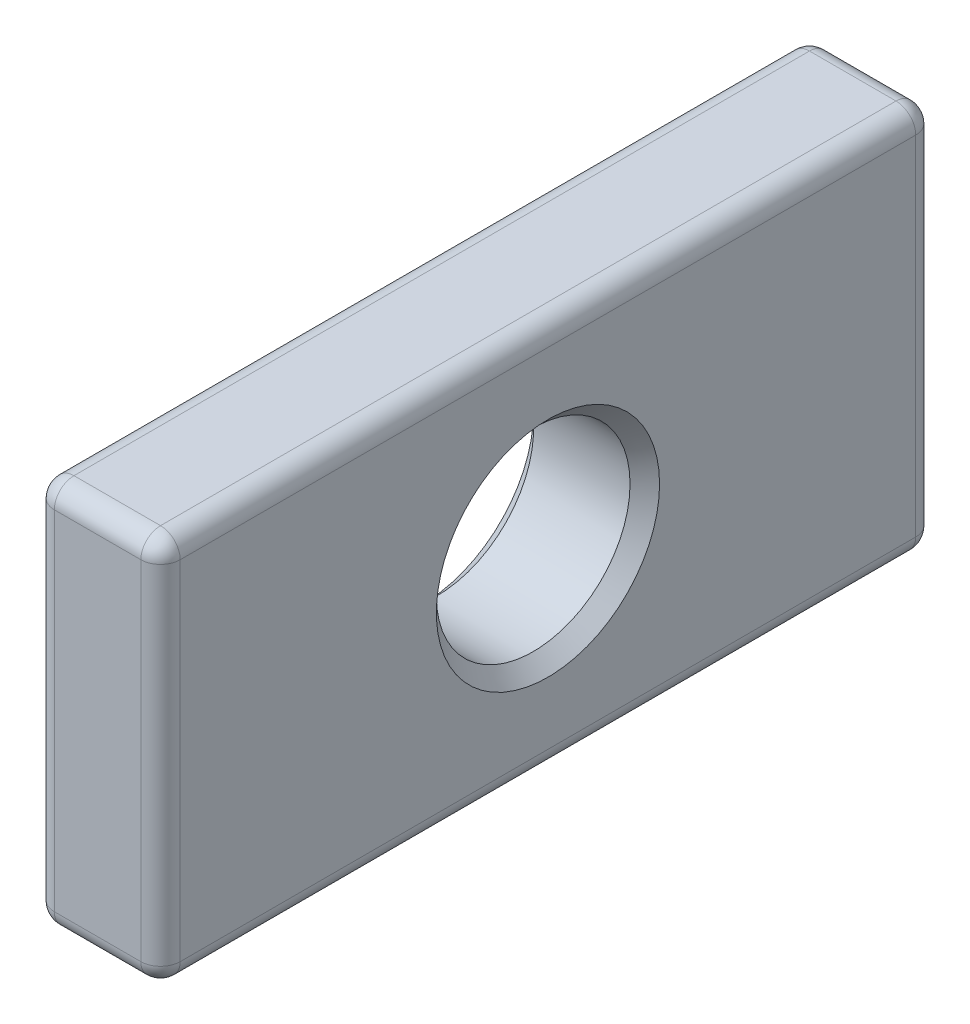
ISO-10303-21;
HEADER;
FILE_DESCRIPTION(('STEP AP214'),'2;1');
FILE_NAME('part.step','',(''),(''),'','','');
FILE_SCHEMA(('AUTOMOTIVE_DESIGN { 1 0 10303 214 1 1 1 1 }'));
ENDSEC;
DATA;
#1=APPLICATION_CONTEXT('core data for automotive mechanical design processes');
#2=APPLICATION_PROTOCOL_DEFINITION('international standard','automotive_design',2000,#1);
#3=PRODUCT_CONTEXT('',#1,'mechanical');
#4=PRODUCT('Part','Part','',(#3));
#5=PRODUCT_RELATED_PRODUCT_CATEGORY('part','',(#4));
#6=PRODUCT_DEFINITION_FORMATION('','',#4);
#7=PRODUCT_DEFINITION_CONTEXT('part definition',#1,'design');
#8=PRODUCT_DEFINITION('design','',#6,#7);
#9=PRODUCT_DEFINITION_SHAPE('','',#8);
#10=(LENGTH_UNIT() NAMED_UNIT(*) SI_UNIT(.MILLI.,.METRE.));
#11=(NAMED_UNIT(*) PLANE_ANGLE_UNIT() SI_UNIT($,.RADIAN.));
#12=(NAMED_UNIT(*) SI_UNIT($,.STERADIAN.) SOLID_ANGLE_UNIT());
#13=UNCERTAINTY_MEASURE_WITH_UNIT(LENGTH_MEASURE(1.E-05),#10,'distance_accuracy_value','');
#14=(GEOMETRIC_REPRESENTATION_CONTEXT(3) GLOBAL_UNCERTAINTY_ASSIGNED_CONTEXT((#13)) GLOBAL_UNIT_ASSIGNED_CONTEXT((#10,
#11,#12)) REPRESENTATION_CONTEXT('',''));
#15=CARTESIAN_POINT('',(0.,0.,0.));
#16=DIRECTION('',(0.,0.,1.));
#17=DIRECTION('',(1.,0.,0.));
#18=AXIS2_PLACEMENT_3D('',#15,#16,#17);
#19=CARTESIAN_POINT('',(3.25,0.,0.));
#20=DIRECTION('',(1.,0.,0.));
#21=DIRECTION('',(0.,0.,-1.));
#22=AXIS2_PLACEMENT_3D('',#19,#20,#21);
#23=PLANE('',#22);
#24=CARTESIAN_POINT('',(3.25,0.,0.));
#25=DIRECTION('',(1.,0.,0.));
#26=DIRECTION('',(0.,0.,-1.));
#27=AXIS2_PLACEMENT_3D('',#24,#25,#26);
#28=CIRCLE('',#27,5.76200000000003);
#29=CARTESIAN_POINT('',(3.25,0.,-5.76200000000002));
#30=VERTEX_POINT('',#29);
#31=EDGE_CURVE('E11',#30,#30,#28,.F.);
#32=ORIENTED_EDGE('',*,*,#31,.T.);
#33=EDGE_LOOP('',(#32));
#34=FACE_BOUND('',#33,.T.);
#35=DIRECTION('',(0.,0.,-1.));
#36=VECTOR('',#35,1.);
#37=CARTESIAN_POINT('',(3.25,-8.984,-20.));
#38=LINE('',#37,#36);
#39=CARTESIAN_POINT('',(3.25,-8.984,18.984));
#40=VERTEX_POINT('',#39);
#41=CARTESIAN_POINT('',(3.25,-8.984,-18.984));
#42=VERTEX_POINT('',#41);
#43=EDGE_CURVE('E130',#40,#42,#38,.T.);
#44=ORIENTED_EDGE('',*,*,#43,.T.);
#45=DIRECTION('',(0.,1.,0.));
#46=VECTOR('',#45,1.);
#47=CARTESIAN_POINT('',(3.25,10.,-18.984));
#48=LINE('',#47,#46);
#49=CARTESIAN_POINT('',(3.25,8.984,-18.984));
#50=VERTEX_POINT('',#49);
#51=EDGE_CURVE('E126',#42,#50,#48,.T.);
#52=ORIENTED_EDGE('',*,*,#51,.T.);
#53=DIRECTION('',(0.,0.,1.));
#54=VECTOR('',#53,1.);
#55=CARTESIAN_POINT('',(3.25,8.984,20.));
#56=LINE('',#55,#54);
#57=CARTESIAN_POINT('',(3.25,8.984,18.984));
#58=VERTEX_POINT('',#57);
#59=EDGE_CURVE('E119',#50,#58,#56,.T.);
#60=ORIENTED_EDGE('',*,*,#59,.T.);
#61=DIRECTION('',(0.,-1.,0.));
#62=VECTOR('',#61,1.);
#63=CARTESIAN_POINT('',(3.25,-10.,18.984));
#64=LINE('',#63,#62);
#65=EDGE_CURVE('E123',#58,#40,#64,.T.);
#66=ORIENTED_EDGE('',*,*,#65,.T.);
#67=EDGE_LOOP('',(#44,#52,#60,#66));
#68=FACE_BOUND('',#67,.T.);
#69=ADVANCED_FACE('F32',(#34,#68),#23,.T.);
#70=CARTESIAN_POINT('',(-3.25,0.,0.));
#71=DIRECTION('',(1.,0.,0.));
#72=DIRECTION('',(0.,0.,-1.));
#73=AXIS2_PLACEMENT_3D('',#70,#71,#72);
#74=PLANE('',#73);
#75=CARTESIAN_POINT('',(-3.25,0.,0.));
#76=DIRECTION('',(1.,0.,0.));
#77=DIRECTION('',(0.,0.,-1.));
#78=AXIS2_PLACEMENT_3D('',#75,#76,#77);
#79=CIRCLE('',#78,5.76199999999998);
#80=CARTESIAN_POINT('',(-3.25,0.,-5.76199999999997));
#81=VERTEX_POINT('',#80);
#82=EDGE_CURVE('E204',#81,#81,#79,.T.);
#83=ORIENTED_EDGE('',*,*,#82,.T.);
#84=EDGE_LOOP('',(#83));
#85=FACE_BOUND('',#84,.T.);
#86=DIRECTION('',(0.,0.,1.));
#87=VECTOR('',#86,1.);
#88=CARTESIAN_POINT('',(-3.25,8.984,0.));
#89=LINE('',#88,#87);
#90=CARTESIAN_POINT('',(-3.25,8.984,18.984));
#91=VERTEX_POINT('',#90);
#92=CARTESIAN_POINT('',(-3.25,8.984,-18.984));
#93=VERTEX_POINT('',#92);
#94=EDGE_CURVE('E175',#91,#93,#89,.F.);
#95=ORIENTED_EDGE('',*,*,#94,.T.);
#96=DIRECTION('',(0.,1.,0.));
#97=VECTOR('',#96,1.);
#98=CARTESIAN_POINT('',(-3.25,0.,-18.984));
#99=LINE('',#98,#97);
#100=CARTESIAN_POINT('',(-3.25,-8.984,-18.984));
#101=VERTEX_POINT('',#100);
#102=EDGE_CURVE('E180',#93,#101,#99,.F.);
#103=ORIENTED_EDGE('',*,*,#102,.T.);
#104=DIRECTION('',(0.,0.,-1.));
#105=VECTOR('',#104,1.);
#106=CARTESIAN_POINT('',(-3.25,-8.984,0.));
#107=LINE('',#106,#105);
#108=CARTESIAN_POINT('',(-3.25,-8.984,18.984));
#109=VERTEX_POINT('',#108);
#110=EDGE_CURVE('E177',#101,#109,#107,.F.);
#111=ORIENTED_EDGE('',*,*,#110,.T.);
#112=DIRECTION('',(0.,-1.,0.));
#113=VECTOR('',#112,1.);
#114=CARTESIAN_POINT('',(-3.25,0.,18.984));
#115=LINE('',#114,#113);
#116=EDGE_CURVE('E173',#109,#91,#115,.F.);
#117=ORIENTED_EDGE('',*,*,#116,.T.);
#118=EDGE_LOOP('',(#95,#103,#111,#117));
#119=FACE_BOUND('',#118,.T.);
#120=ADVANCED_FACE('F270',(#85,#119),#74,.F.);
#121=CARTESIAN_POINT('',(3.25,10.,-20.));
#122=DIRECTION('',(0.,0.,1.));
#123=DIRECTION('',(1.,0.,0.));
#124=AXIS2_PLACEMENT_3D('',#121,#122,#123);
#125=PLANE('',#124);
#126=DIRECTION('',(0.,1.,0.));
#127=VECTOR('',#126,1.);
#128=CARTESIAN_POINT('',(2.234,-10.,-20.));
#129=LINE('',#128,#127);
#130=CARTESIAN_POINT('',(2.234,8.984,-20.));
#131=VERTEX_POINT('',#130);
#132=CARTESIAN_POINT('',(2.234,-8.98399999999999,-20.));
#133=VERTEX_POINT('',#132);
#134=EDGE_CURVE('E193',#131,#133,#129,.F.);
#135=ORIENTED_EDGE('',*,*,#134,.T.);
#136=DIRECTION('',(-1.,0.,0.));
#137=VECTOR('',#136,1.);
#138=CARTESIAN_POINT('',(3.25,-8.98399999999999,-20.));
#139=LINE('',#138,#137);
#140=CARTESIAN_POINT('',(-2.234,-8.98399999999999,-20.));
#141=VERTEX_POINT('',#140);
#142=EDGE_CURVE('E195',#133,#141,#139,.T.);
#143=ORIENTED_EDGE('',*,*,#142,.T.);
#144=DIRECTION('',(0.,1.,0.));
#145=VECTOR('',#144,1.);
#146=CARTESIAN_POINT('',(-2.234,10.,-20.));
#147=LINE('',#146,#145);
#148=CARTESIAN_POINT('',(-2.234,8.984,-20.));
#149=VERTEX_POINT('',#148);
#150=EDGE_CURVE('E189',#141,#149,#147,.T.);
#151=ORIENTED_EDGE('',*,*,#150,.T.);
#152=DIRECTION('',(-1.,0.,0.));
#153=VECTOR('',#152,1.);
#154=CARTESIAN_POINT('',(3.25,8.984,-20.));
#155=LINE('',#154,#153);
#156=EDGE_CURVE('E191',#149,#131,#155,.F.);
#157=ORIENTED_EDGE('',*,*,#156,.T.);
#158=EDGE_LOOP('',(#135,#143,#151,#157));
#159=FACE_BOUND('',#158,.T.);
#160=ADVANCED_FACE('F273',(#159),#125,.F.);
#161=CARTESIAN_POINT('',(3.25,10.,20.));
#162=DIRECTION('',(0.,-1.,0.));
#163=DIRECTION('',(0.,0.,-1.));
#164=AXIS2_PLACEMENT_3D('',#161,#162,#163);
#165=PLANE('',#164);
#166=DIRECTION('',(0.,0.,1.));
#167=VECTOR('',#166,1.);
#168=CARTESIAN_POINT('',(2.234,10.,-20.));
#169=LINE('',#168,#167);
#170=CARTESIAN_POINT('',(2.234,10.,18.984));
#171=VERTEX_POINT('',#170);
#172=CARTESIAN_POINT('',(2.234,10.,-18.984));
#173=VERTEX_POINT('',#172);
#174=EDGE_CURVE('E138',#171,#173,#169,.F.);
#175=ORIENTED_EDGE('',*,*,#174,.T.);
#176=DIRECTION('',(-1.,0.,0.));
#177=VECTOR('',#176,1.);
#178=CARTESIAN_POINT('',(3.25,10.,-18.984));
#179=LINE('',#178,#177);
#180=CARTESIAN_POINT('',(-2.234,10.,-18.984));
#181=VERTEX_POINT('',#180);
#182=EDGE_CURVE('E187',#173,#181,#179,.T.);
#183=ORIENTED_EDGE('',*,*,#182,.T.);
#184=DIRECTION('',(0.,0.,1.));
#185=VECTOR('',#184,1.);
#186=CARTESIAN_POINT('',(-2.234,10.,20.));
#187=LINE('',#186,#185);
#188=CARTESIAN_POINT('',(-2.234,10.,18.984));
#189=VERTEX_POINT('',#188);
#190=EDGE_CURVE('E184',#181,#189,#187,.T.);
#191=ORIENTED_EDGE('',*,*,#190,.T.);
#192=DIRECTION('',(-1.,0.,0.));
#193=VECTOR('',#192,1.);
#194=CARTESIAN_POINT('',(3.25,10.,18.984));
#195=LINE('',#194,#193);
#196=EDGE_CURVE('E182',#189,#171,#195,.F.);
#197=ORIENTED_EDGE('',*,*,#196,.T.);
#198=EDGE_LOOP('',(#175,#183,#191,#197));
#199=FACE_BOUND('',#198,.T.);
#200=ADVANCED_FACE('F317',(#199),#165,.F.);
#201=CARTESIAN_POINT('',(3.25,10.,20.));
#202=DIRECTION('',(0.,0.,-1.));
#203=DIRECTION('',(-1.,0.,0.));
#204=AXIS2_PLACEMENT_3D('',#201,#202,#203);
#205=PLANE('',#204);
#206=DIRECTION('',(0.,-1.,0.));
#207=VECTOR('',#206,1.);
#208=CARTESIAN_POINT('',(2.234,10.,20.));
#209=LINE('',#208,#207);
#210=CARTESIAN_POINT('',(2.234,-8.984,20.));
#211=VERTEX_POINT('',#210);
#212=CARTESIAN_POINT('',(2.234,8.984,20.));
#213=VERTEX_POINT('',#212);
#214=EDGE_CURVE('E47',#211,#213,#209,.F.);
#215=ORIENTED_EDGE('',*,*,#214,.T.);
#216=DIRECTION('',(-1.,0.,0.));
#217=VECTOR('',#216,1.);
#218=CARTESIAN_POINT('',(3.25,8.984,20.));
#219=LINE('',#218,#217);
#220=CARTESIAN_POINT('',(-2.234,8.984,20.));
#221=VERTEX_POINT('',#220);
#222=EDGE_CURVE('E202',#213,#221,#219,.T.);
#223=ORIENTED_EDGE('',*,*,#222,.T.);
#224=DIRECTION('',(0.,-1.,0.));
#225=VECTOR('',#224,1.);
#226=CARTESIAN_POINT('',(-2.234,10.,20.));
#227=LINE('',#226,#225);
#228=CARTESIAN_POINT('',(-2.234,-8.984,20.));
#229=VERTEX_POINT('',#228);
#230=EDGE_CURVE('E198',#221,#229,#227,.T.);
#231=ORIENTED_EDGE('',*,*,#230,.T.);
#232=DIRECTION('',(-1.,0.,0.));
#233=VECTOR('',#232,1.);
#234=CARTESIAN_POINT('',(3.25,-8.984,20.));
#235=LINE('',#234,#233);
#236=EDGE_CURVE('E52',#229,#211,#235,.F.);
#237=ORIENTED_EDGE('',*,*,#236,.T.);
#238=EDGE_LOOP('',(#215,#223,#231,#237));
#239=FACE_BOUND('',#238,.T.);
#240=ADVANCED_FACE('F314',(#239),#205,.F.);
#241=CARTESIAN_POINT('',(3.25,-10.,20.));
#242=DIRECTION('',(0.,1.,0.));
#243=DIRECTION('',(0.,0.,1.));
#244=AXIS2_PLACEMENT_3D('',#241,#242,#243);
#245=PLANE('',#244);
#246=DIRECTION('',(0.,0.,-1.));
#247=VECTOR('',#246,1.);
#248=CARTESIAN_POINT('',(-2.234,-10.,20.));
#249=LINE('',#248,#247);
#250=CARTESIAN_POINT('',(-2.234,-10.,18.984));
#251=VERTEX_POINT('',#250);
#252=CARTESIAN_POINT('',(-2.234,-10.,-18.984));
#253=VERTEX_POINT('',#252);
#254=EDGE_CURVE('E166',#251,#253,#249,.T.);
#255=ORIENTED_EDGE('',*,*,#254,.T.);
#256=DIRECTION('',(-1.,0.,0.));
#257=VECTOR('',#256,1.);
#258=CARTESIAN_POINT('',(3.25,-10.,-18.984));
#259=LINE('',#258,#257);
#260=CARTESIAN_POINT('',(2.234,-10.,-18.984));
#261=VERTEX_POINT('',#260);
#262=EDGE_CURVE('E171',#253,#261,#259,.F.);
#263=ORIENTED_EDGE('',*,*,#262,.T.);
#264=DIRECTION('',(0.,0.,-1.));
#265=VECTOR('',#264,1.);
#266=CARTESIAN_POINT('',(2.234,-10.,20.));
#267=LINE('',#266,#265);
#268=CARTESIAN_POINT('',(2.234,-10.,18.984));
#269=VERTEX_POINT('',#268);
#270=EDGE_CURVE('E168',#261,#269,#267,.F.);
#271=ORIENTED_EDGE('',*,*,#270,.T.);
#272=DIRECTION('',(-1.,0.,0.));
#273=VECTOR('',#272,1.);
#274=CARTESIAN_POINT('',(3.25,-10.,18.984));
#275=LINE('',#274,#273);
#276=EDGE_CURVE('E164',#269,#251,#275,.T.);
#277=ORIENTED_EDGE('',*,*,#276,.T.);
#278=EDGE_LOOP('',(#255,#263,#271,#277));
#279=FACE_BOUND('',#278,.T.);
#280=ADVANCED_FACE('F316',(#279),#245,.F.);
#281=CARTESIAN_POINT('',(3.25,0.,0.));
#282=DIRECTION('',(-1.,0.,0.));
#283=DIRECTION('',(0.,0.,1.));
#284=AXIS2_PLACEMENT_3D('',#281,#282,#283);
#285=CYLINDRICAL_SURFACE('',#284,5.);
#286=CARTESIAN_POINT('',(-2.48800000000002,0.,0.));
#287=DIRECTION('',(1.,0.,0.));
#288=DIRECTION('',(0.,0.,-1.));
#289=AXIS2_PLACEMENT_3D('',#286,#287,#288);
#290=CIRCLE('',#289,5.);
#291=CARTESIAN_POINT('',(-2.48800000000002,0.,5.00000000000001));
#292=VERTEX_POINT('',#291);
#293=EDGE_CURVE('E40',#292,#292,#290,.F.);
#294=CARTESIAN_POINT('',(2.48799999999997,0.,0.));
#295=DIRECTION('',(1.,0.,0.));
#296=DIRECTION('',(0.,0.,-1.));
#297=AXIS2_PLACEMENT_3D('',#294,#295,#296);
#298=CIRCLE('',#297,5.);
#299=CARTESIAN_POINT('',(2.48799999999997,0.,5.00000000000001));
#300=VERTEX_POINT('',#299);
#301=EDGE_CURVE('E256',#300,#300,#298,.T.);
#302=CARTESIAN_POINT('',(-2.48800000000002,0.,5.00000000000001));
#303=CARTESIAN_POINT('',(-2.43616666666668,0.,5.00000000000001));
#304=CARTESIAN_POINT('',(-2.38433333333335,0.,5.00000000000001));
#305=CARTESIAN_POINT('',(-2.28066666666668,0.,5.00000000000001));
#306=CARTESIAN_POINT('',(-2.22883333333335,0.,5.00000000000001));
#307=CARTESIAN_POINT('',(-2.12516666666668,0.,5.00000000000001));
#308=CARTESIAN_POINT('',(-2.07333333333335,0.,5.00000000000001));
#309=CARTESIAN_POINT('',(-1.96966666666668,0.,5.00000000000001));
#310=CARTESIAN_POINT('',(-1.91783333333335,0.,5.00000000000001));
#311=CARTESIAN_POINT('',(-1.81416666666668,0.,5.00000000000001));
#312=CARTESIAN_POINT('',(-1.76233333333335,0.,5.00000000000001));
#313=CARTESIAN_POINT('',(-1.65866666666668,0.,5.00000000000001));
#314=CARTESIAN_POINT('',(-1.60683333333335,0.,5.00000000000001));
#315=CARTESIAN_POINT('',(-1.50316666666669,0.,5.00000000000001));
#316=CARTESIAN_POINT('',(-1.45133333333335,0.,5.00000000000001));
#317=CARTESIAN_POINT('',(-1.34766666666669,0.,5.00000000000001));
#318=CARTESIAN_POINT('',(-1.29583333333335,0.,5.00000000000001));
#319=CARTESIAN_POINT('',(-1.19216666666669,0.,5.00000000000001));
#320=CARTESIAN_POINT('',(-1.14033333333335,0.,5.00000000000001));
#321=CARTESIAN_POINT('',(-1.03666666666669,0.,5.00000000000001));
#322=CARTESIAN_POINT('',(-0.984833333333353,0.,5.00000000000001));
#323=CARTESIAN_POINT('',(-0.881166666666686,0.,5.00000000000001));
#324=CARTESIAN_POINT('',(-0.829333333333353,0.,5.00000000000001));
#325=CARTESIAN_POINT('',(-0.725666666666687,0.,5.00000000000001));
#326=CARTESIAN_POINT('',(-0.673833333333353,0.,5.00000000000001));
#327=CARTESIAN_POINT('',(-0.570166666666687,0.,5.00000000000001));
#328=CARTESIAN_POINT('',(-0.518333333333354,0.,5.00000000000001));
#329=CARTESIAN_POINT('',(-0.414666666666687,0.,5.00000000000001));
#330=CARTESIAN_POINT('',(-0.362833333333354,0.,5.00000000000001));
#331=CARTESIAN_POINT('',(-0.259166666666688,0.,5.00000000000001));
#332=CARTESIAN_POINT('',(-0.207333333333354,0.,5.00000000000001));
#333=CARTESIAN_POINT('',(-0.103666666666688,0.,5.00000000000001));
#334=CARTESIAN_POINT('',(-0.0518333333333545,0.,5.00000000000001));
#335=CARTESIAN_POINT('',(0.051833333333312,0.,5.00000000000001));
#336=CARTESIAN_POINT('',(0.103666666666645,0.,5.00000000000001));
#337=CARTESIAN_POINT('',(0.207333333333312,0.,5.00000000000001));
#338=CARTESIAN_POINT('',(0.259166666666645,0.,5.00000000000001));
#339=CARTESIAN_POINT('',(0.362833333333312,0.,5.00000000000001));
#340=CARTESIAN_POINT('',(0.414666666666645,0.,5.00000000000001));
#341=CARTESIAN_POINT('',(0.518333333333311,0.,5.00000000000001));
#342=CARTESIAN_POINT('',(0.570166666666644,0.,5.00000000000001));
#343=CARTESIAN_POINT('',(0.673833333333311,0.,5.00000000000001));
#344=CARTESIAN_POINT('',(0.725666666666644,0.,5.00000000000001));
#345=CARTESIAN_POINT('',(0.829333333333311,0.,5.00000000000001));
#346=CARTESIAN_POINT('',(0.881166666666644,0.,5.00000000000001));
#347=CARTESIAN_POINT('',(0.98483333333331,0.,5.00000000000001));
#348=CARTESIAN_POINT('',(1.03666666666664,0.,5.00000000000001));
#349=CARTESIAN_POINT('',(1.14033333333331,0.,5.00000000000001));
#350=CARTESIAN_POINT('',(1.19216666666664,0.,5.00000000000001));
#351=CARTESIAN_POINT('',(1.29583333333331,0.,5.00000000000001));
#352=CARTESIAN_POINT('',(1.34766666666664,0.,5.00000000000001));
#353=CARTESIAN_POINT('',(1.45133333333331,0.,5.00000000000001));
#354=CARTESIAN_POINT('',(1.50316666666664,0.,5.00000000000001));
#355=CARTESIAN_POINT('',(1.60683333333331,0.,5.00000000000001));
#356=CARTESIAN_POINT('',(1.65866666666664,0.,5.00000000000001));
#357=CARTESIAN_POINT('',(1.76233333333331,0.,5.00000000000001));
#358=CARTESIAN_POINT('',(1.81416666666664,0.,5.00000000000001));
#359=CARTESIAN_POINT('',(1.91783333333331,0.,5.00000000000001));
#360=CARTESIAN_POINT('',(1.96966666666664,0.,5.00000000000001));
#361=CARTESIAN_POINT('',(2.07333333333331,0.,5.00000000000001));
#362=CARTESIAN_POINT('',(2.12516666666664,0.,5.00000000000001));
#363=CARTESIAN_POINT('',(2.22883333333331,0.,5.00000000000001));
#364=CARTESIAN_POINT('',(2.28066666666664,0.,5.00000000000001));
#365=CARTESIAN_POINT('',(2.38433333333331,0.,5.00000000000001));
#366=CARTESIAN_POINT('',(2.43616666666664,0.,5.00000000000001));
#367=CARTESIAN_POINT('',(2.48799999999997,0.,5.00000000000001));
#368=B_SPLINE_CURVE_WITH_KNOTS('',3,(#302,#303,#304,#305,#306,#307,#308,#309,#310,#311,#312,
#313,#314,#315,#316,#317,#318,#319,#320,#321,#322,#323,#324,#325,#326,#327,#328,#329,#330,#331,
#332,#333,#334,#335,#336,#337,#338,#339,#340,#341,#342,#343,#344,#345,#346,#347,#348,#349,#350,
#351,#352,#353,#354,#355,#356,#357,#358,#359,#360,#361,#362,#363,#364,#365,#366,#367),
.UNSPECIFIED.,.F.,.F.,(4,2,2,2,2,2,2,2,2,2,2,2,2,2,2,2,2,2,2,2,2,2,2,2,2,2,2,2,2,2,2,2,4),(0.,
0.155499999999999,0.311,0.466499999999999,0.621999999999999,0.777499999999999,0.932999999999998,
1.0885,1.244,1.3995,1.555,1.7105,1.866,2.0215,2.177,2.3325,2.488,2.6435,2.799,2.95449999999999,
3.10999999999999,3.26549999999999,3.42099999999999,3.57649999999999,3.73199999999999,
3.88749999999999,4.04299999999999,4.19849999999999,4.35399999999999,4.50949999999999,
4.66499999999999,4.82049999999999,4.97599999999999),.UNSPECIFIED.);
#369=EDGE_CURVE('BSEAM261',#292,#300,#368,.T.);
#370=ORIENTED_EDGE('',*,*,#293,.T.);
#371=ORIENTED_EDGE('',*,*,#301,.T.);
#372=ORIENTED_EDGE('',*,*,#369,.T.);
#373=ORIENTED_EDGE('',*,*,#369,.F.);
#374=EDGE_LOOP('',(#370,#372,#371,#373));
#375=FACE_BOUND('',#374,.T.);
#376=ADVANCED_FACE('F261',(#375),#285,.F.);
#377=CARTESIAN_POINT('',(-2.234,8.984,20.));
#378=DIRECTION('',(0.,0.,1.));
#379=DIRECTION('',(1.,0.,0.));
#380=AXIS2_PLACEMENT_3D('',#377,#378,#379);
#381=CYLINDRICAL_SURFACE('',#380,1.016);
#382=CARTESIAN_POINT('',(-2.234,8.984,18.984));
#383=DIRECTION('',(0.,0.,1.));
#384=DIRECTION('',(1.,0.,0.));
#385=AXIS2_PLACEMENT_3D('',#382,#383,#384);
#386=CIRCLE('',#385,1.016);
#387=EDGE_CURVE('E156',#189,#91,#386,.T.);
#388=ORIENTED_EDGE('',*,*,#387,.F.);
#389=ORIENTED_EDGE('',*,*,#190,.F.);
#390=CARTESIAN_POINT('',(-2.234,8.984,-18.984));
#391=DIRECTION('',(0.,0.,-1.));
#392=DIRECTION('',(0.,1.,0.));
#393=AXIS2_PLACEMENT_3D('',#390,#391,#392);
#394=CIRCLE('',#393,1.016);
#395=EDGE_CURVE('E159',#93,#181,#394,.T.);
#396=ORIENTED_EDGE('',*,*,#395,.F.);
#397=ORIENTED_EDGE('',*,*,#94,.F.);
#398=EDGE_LOOP('',(#388,#389,#396,#397));
#399=FACE_BOUND('',#398,.T.);
#400=ADVANCED_FACE('F284',(#399),#381,.T.);
#401=CARTESIAN_POINT('',(-2.234,8.984,18.984));
#402=DIRECTION('',(0.,0.,1.));
#403=DIRECTION('',(1.,0.,0.));
#404=AXIS2_PLACEMENT_3D('',#401,#402,#403);
#405=SPHERICAL_SURFACE('',#404,1.016);
#406=CARTESIAN_POINT('',(-2.234,8.984,18.984));
#407=DIRECTION('',(-1.,0.,0.));
#408=DIRECTION('',(0.,0.,1.));
#409=AXIS2_PLACEMENT_3D('',#406,#407,#408);
#410=CIRCLE('',#409,1.016);
#411=EDGE_CURVE('E246',#189,#221,#410,.F.);
#412=ORIENTED_EDGE('',*,*,#411,.F.);
#413=ORIENTED_EDGE('',*,*,#387,.T.);
#414=CARTESIAN_POINT('',(-2.234,8.984,18.984));
#415=DIRECTION('',(0.,1.,0.));
#416=DIRECTION('',(0.,0.,1.));
#417=AXIS2_PLACEMENT_3D('',#414,#415,#416);
#418=CIRCLE('',#417,1.016);
#419=EDGE_CURVE('E249',#221,#91,#418,.F.);
#420=ORIENTED_EDGE('',*,*,#419,.F.);
#421=EDGE_LOOP('',(#412,#413,#420));
#422=FACE_BOUND('',#421,.T.);
#423=ADVANCED_FACE('F310',(#422),#405,.T.);
#424=CARTESIAN_POINT('',(-2.234,8.984,-18.984));
#425=DIRECTION('',(0.,0.,1.));
#426=DIRECTION('',(1.,0.,0.));
#427=AXIS2_PLACEMENT_3D('',#424,#425,#426);
#428=SPHERICAL_SURFACE('',#427,1.016);
#429=CARTESIAN_POINT('',(-2.234,8.984,-18.984));
#430=DIRECTION('',(0.,1.,0.));
#431=DIRECTION('',(0.,0.,1.));
#432=AXIS2_PLACEMENT_3D('',#429,#430,#431);
#433=CIRCLE('',#432,1.016);
#434=EDGE_CURVE('E240',#93,#149,#433,.F.);
#435=ORIENTED_EDGE('',*,*,#434,.F.);
#436=ORIENTED_EDGE('',*,*,#395,.T.);
#437=CARTESIAN_POINT('',(-2.234,8.984,-18.984));
#438=DIRECTION('',(-1.,0.,0.));
#439=DIRECTION('',(0.,0.,1.));
#440=AXIS2_PLACEMENT_3D('',#437,#438,#439);
#441=CIRCLE('',#440,1.016);
#442=EDGE_CURVE('E243',#149,#181,#441,.F.);
#443=ORIENTED_EDGE('',*,*,#442,.F.);
#444=EDGE_LOOP('',(#435,#436,#443));
#445=FACE_BOUND('',#444,.T.);
#446=ADVANCED_FACE('F287',(#445),#428,.T.);
#447=CARTESIAN_POINT('',(-2.234,10.,18.984));
#448=DIRECTION('',(0.,-1.,0.));
#449=DIRECTION('',(0.,0.,-1.));
#450=AXIS2_PLACEMENT_3D('',#447,#448,#449);
#451=CYLINDRICAL_SURFACE('',#450,1.016);
#452=ORIENTED_EDGE('',*,*,#419,.T.);
#453=ORIENTED_EDGE('',*,*,#116,.F.);
#454=CARTESIAN_POINT('',(-2.234,-8.984,18.984));
#455=DIRECTION('',(0.,-1.,0.));
#456=DIRECTION('',(0.,0.,-1.));
#457=AXIS2_PLACEMENT_3D('',#454,#455,#456);
#458=CIRCLE('',#457,1.016);
#459=EDGE_CURVE('E235',#229,#109,#458,.T.);
#460=ORIENTED_EDGE('',*,*,#459,.F.);
#461=ORIENTED_EDGE('',*,*,#230,.F.);
#462=EDGE_LOOP('',(#452,#453,#460,#461));
#463=FACE_BOUND('',#462,.T.);
#464=ADVANCED_FACE('F306',(#463),#451,.T.);
#465=CARTESIAN_POINT('',(3.25,8.984,18.984));
#466=DIRECTION('',(-1.,0.,0.));
#467=DIRECTION('',(0.,0.,1.));
#468=AXIS2_PLACEMENT_3D('',#465,#466,#467);
#469=CYLINDRICAL_SURFACE('',#468,1.016);
#470=ORIENTED_EDGE('',*,*,#411,.T.);
#471=ORIENTED_EDGE('',*,*,#222,.F.);
#472=CARTESIAN_POINT('',(2.234,8.984,18.984));
#473=DIRECTION('',(1.,0.,0.));
#474=DIRECTION('',(0.,0.,-1.));
#475=AXIS2_PLACEMENT_3D('',#472,#473,#474);
#476=CIRCLE('',#475,1.016);
#477=EDGE_CURVE('E142',#171,#213,#476,.T.);
#478=ORIENTED_EDGE('',*,*,#477,.F.);
#479=ORIENTED_EDGE('',*,*,#196,.F.);
#480=EDGE_LOOP('',(#470,#471,#478,#479));
#481=FACE_BOUND('',#480,.T.);
#482=ADVANCED_FACE('F313',(#481),#469,.T.);
#483=CARTESIAN_POINT('',(2.234,8.984,0.));
#484=DIRECTION('',(0.,0.,-1.));
#485=DIRECTION('',(-1.,0.,0.));
#486=AXIS2_PLACEMENT_3D('',#483,#484,#485);
#487=CYLINDRICAL_SURFACE('',#486,1.016);
#488=CARTESIAN_POINT('',(2.234,8.984,-18.984));
#489=DIRECTION('',(0.,0.,-1.));
#490=DIRECTION('',(-1.,0.,0.));
#491=AXIS2_PLACEMENT_3D('',#488,#489,#490);
#492=CIRCLE('',#491,1.016);
#493=EDGE_CURVE('E143',#173,#50,#492,.T.);
#494=ORIENTED_EDGE('',*,*,#493,.F.);
#495=ORIENTED_EDGE('',*,*,#174,.F.);
#496=CARTESIAN_POINT('',(2.234,8.984,18.984));
#497=DIRECTION('',(0.,0.,1.));
#498=DIRECTION('',(1.,0.,0.));
#499=AXIS2_PLACEMENT_3D('',#496,#497,#498);
#500=CIRCLE('',#499,1.016);
#501=EDGE_CURVE('E134',#58,#171,#500,.T.);
#502=ORIENTED_EDGE('',*,*,#501,.F.);
#503=ORIENTED_EDGE('',*,*,#59,.F.);
#504=EDGE_LOOP('',(#494,#495,#502,#503));
#505=FACE_BOUND('',#504,.T.);
#506=ADVANCED_FACE('F136',(#505),#487,.T.);
#507=CARTESIAN_POINT('',(3.25,8.984,-18.984));
#508=DIRECTION('',(-1.,0.,0.));
#509=DIRECTION('',(0.,0.,1.));
#510=AXIS2_PLACEMENT_3D('',#507,#508,#509);
#511=CYLINDRICAL_SURFACE('',#510,1.016);
#512=ORIENTED_EDGE('',*,*,#442,.T.);
#513=ORIENTED_EDGE('',*,*,#182,.F.);
#514=CARTESIAN_POINT('',(2.234,8.984,-18.984));
#515=DIRECTION('',(1.,0.,0.));
#516=DIRECTION('',(0.,0.,-1.));
#517=AXIS2_PLACEMENT_3D('',#514,#515,#516);
#518=CIRCLE('',#517,1.016);
#519=EDGE_CURVE('E231',#131,#173,#518,.T.);
#520=ORIENTED_EDGE('',*,*,#519,.F.);
#521=ORIENTED_EDGE('',*,*,#156,.F.);
#522=EDGE_LOOP('',(#512,#513,#520,#521));
#523=FACE_BOUND('',#522,.T.);
#524=ADVANCED_FACE('F351',(#523),#511,.T.);
#525=CARTESIAN_POINT('',(-2.234,10.,-18.984));
#526=DIRECTION('',(0.,1.,0.));
#527=DIRECTION('',(0.,0.,1.));
#528=AXIS2_PLACEMENT_3D('',#525,#526,#527);
#529=CYLINDRICAL_SURFACE('',#528,1.016);
#530=ORIENTED_EDGE('',*,*,#434,.T.);
#531=ORIENTED_EDGE('',*,*,#150,.F.);
#532=CARTESIAN_POINT('',(-2.234,-8.984,-18.984));
#533=DIRECTION('',(0.,-1.,0.));
#534=DIRECTION('',(0.,0.,-1.));
#535=AXIS2_PLACEMENT_3D('',#532,#533,#534);
#536=CIRCLE('',#535,1.016);
#537=EDGE_CURVE('E228',#101,#141,#536,.T.);
#538=ORIENTED_EDGE('',*,*,#537,.F.);
#539=ORIENTED_EDGE('',*,*,#102,.F.);
#540=EDGE_LOOP('',(#530,#531,#538,#539));
#541=FACE_BOUND('',#540,.T.);
#542=ADVANCED_FACE('F292',(#541),#529,.T.);
#543=CARTESIAN_POINT('',(-2.234,-8.984,20.));
#544=DIRECTION('',(0.,0.,-1.));
#545=DIRECTION('',(-1.,0.,0.));
#546=AXIS2_PLACEMENT_3D('',#543,#544,#545);
#547=CYLINDRICAL_SURFACE('',#546,1.016);
#548=CARTESIAN_POINT('',(-2.234,-8.984,18.984));
#549=DIRECTION('',(0.,0.,1.));
#550=DIRECTION('',(1.,0.,0.));
#551=AXIS2_PLACEMENT_3D('',#548,#549,#550);
#552=CIRCLE('',#551,1.016);
#553=EDGE_CURVE('E237',#109,#251,#552,.T.);
#554=ORIENTED_EDGE('',*,*,#553,.F.);
#555=ORIENTED_EDGE('',*,*,#110,.F.);
#556=CARTESIAN_POINT('',(-2.234,-8.984,-18.984));
#557=DIRECTION('',(0.,0.,-1.));
#558=DIRECTION('',(-1.,0.,0.));
#559=AXIS2_PLACEMENT_3D('',#556,#557,#558);
#560=CIRCLE('',#559,1.016);
#561=EDGE_CURVE('E225',#253,#101,#560,.T.);
#562=ORIENTED_EDGE('',*,*,#561,.F.);
#563=ORIENTED_EDGE('',*,*,#254,.F.);
#564=EDGE_LOOP('',(#554,#555,#562,#563));
#565=FACE_BOUND('',#564,.T.);
#566=ADVANCED_FACE('F301',(#565),#547,.T.);
#567=CARTESIAN_POINT('',(-2.234,-8.984,18.984));
#568=DIRECTION('',(0.,0.,1.));
#569=DIRECTION('',(1.,0.,0.));
#570=AXIS2_PLACEMENT_3D('',#567,#568,#569);
#571=SPHERICAL_SURFACE('',#570,1.016);
#572=ORIENTED_EDGE('',*,*,#459,.T.);
#573=ORIENTED_EDGE('',*,*,#553,.T.);
#574=CARTESIAN_POINT('',(-2.234,-8.984,18.984));
#575=DIRECTION('',(-1.,0.,0.));
#576=DIRECTION('',(0.,0.,1.));
#577=AXIS2_PLACEMENT_3D('',#574,#575,#576);
#578=CIRCLE('',#577,1.016);
#579=EDGE_CURVE('E149',#229,#251,#578,.F.);
#580=ORIENTED_EDGE('',*,*,#579,.F.);
#581=EDGE_LOOP('',(#572,#573,#580));
#582=FACE_BOUND('',#581,.T.);
#583=ADVANCED_FACE('F359',(#582),#571,.T.);
#584=CARTESIAN_POINT('',(2.234,8.984,18.984));
#585=DIRECTION('',(0.,0.,1.));
#586=DIRECTION('',(1.,0.,0.));
#587=AXIS2_PLACEMENT_3D('',#584,#585,#586);
#588=SPHERICAL_SURFACE('',#587,1.016);
#589=ORIENTED_EDGE('',*,*,#501,.T.);
#590=ORIENTED_EDGE('',*,*,#477,.T.);
#591=CARTESIAN_POINT('',(2.234,8.984,18.984));
#592=DIRECTION('',(0.,1.,0.));
#593=DIRECTION('',(0.,0.,1.));
#594=AXIS2_PLACEMENT_3D('',#591,#592,#593);
#595=CIRCLE('',#594,1.016);
#596=EDGE_CURVE('E146',#58,#213,#595,.F.);
#597=ORIENTED_EDGE('',*,*,#596,.F.);
#598=EDGE_LOOP('',(#589,#590,#597));
#599=FACE_BOUND('',#598,.T.);
#600=ADVANCED_FACE('F147',(#599),#588,.T.);
#601=CARTESIAN_POINT('',(2.234,8.984,-18.984));
#602=DIRECTION('',(0.,0.,1.));
#603=DIRECTION('',(1.,0.,0.));
#604=AXIS2_PLACEMENT_3D('',#601,#602,#603);
#605=SPHERICAL_SURFACE('',#604,1.016);
#606=ORIENTED_EDGE('',*,*,#519,.T.);
#607=ORIENTED_EDGE('',*,*,#493,.T.);
#608=CARTESIAN_POINT('',(2.234,8.984,-18.984));
#609=DIRECTION('',(0.,1.,0.));
#610=DIRECTION('',(0.,0.,1.));
#611=AXIS2_PLACEMENT_3D('',#608,#609,#610);
#612=CIRCLE('',#611,1.016);
#613=EDGE_CURVE('E150',#131,#50,#612,.F.);
#614=ORIENTED_EDGE('',*,*,#613,.F.);
#615=EDGE_LOOP('',(#606,#607,#614));
#616=FACE_BOUND('',#615,.T.);
#617=ADVANCED_FACE('F364',(#616),#605,.T.);
#618=CARTESIAN_POINT('',(-2.234,-8.984,-18.984));
#619=DIRECTION('',(0.,0.,1.));
#620=DIRECTION('',(1.,0.,0.));
#621=AXIS2_PLACEMENT_3D('',#618,#619,#620);
#622=SPHERICAL_SURFACE('',#621,1.016);
#623=ORIENTED_EDGE('',*,*,#561,.T.);
#624=ORIENTED_EDGE('',*,*,#537,.T.);
#625=CARTESIAN_POINT('',(-2.234,-8.98399999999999,-18.984));
#626=DIRECTION('',(-1.,0.,0.));
#627=DIRECTION('',(0.,0.,1.));
#628=AXIS2_PLACEMENT_3D('',#625,#626,#627);
#629=CIRCLE('',#628,1.016);
#630=EDGE_CURVE('E219',#253,#141,#629,.F.);
#631=ORIENTED_EDGE('',*,*,#630,.F.);
#632=EDGE_LOOP('',(#623,#624,#631));
#633=FACE_BOUND('',#632,.T.);
#634=ADVANCED_FACE('F296',(#633),#622,.T.);
#635=CARTESIAN_POINT('',(3.25,-8.984,18.984));
#636=DIRECTION('',(-1.,0.,0.));
#637=DIRECTION('',(0.,0.,1.));
#638=AXIS2_PLACEMENT_3D('',#635,#636,#637);
#639=CYLINDRICAL_SURFACE('',#638,1.016);
#640=ORIENTED_EDGE('',*,*,#579,.T.);
#641=ORIENTED_EDGE('',*,*,#276,.F.);
#642=CARTESIAN_POINT('',(2.234,-8.984,18.984));
#643=DIRECTION('',(1.,0.,0.));
#644=DIRECTION('',(0.,0.,-1.));
#645=AXIS2_PLACEMENT_3D('',#642,#643,#644);
#646=CIRCLE('',#645,1.016);
#647=EDGE_CURVE('E216',#211,#269,#646,.T.);
#648=ORIENTED_EDGE('',*,*,#647,.F.);
#649=ORIENTED_EDGE('',*,*,#236,.F.);
#650=EDGE_LOOP('',(#640,#641,#648,#649));
#651=FACE_BOUND('',#650,.T.);
#652=ADVANCED_FACE('F370',(#651),#639,.T.);
#653=CARTESIAN_POINT('',(2.234,0.,18.984));
#654=DIRECTION('',(0.,1.,0.));
#655=DIRECTION('',(0.,0.,1.));
#656=AXIS2_PLACEMENT_3D('',#653,#654,#655);
#657=CYLINDRICAL_SURFACE('',#656,1.016);
#658=ORIENTED_EDGE('',*,*,#596,.T.);
#659=ORIENTED_EDGE('',*,*,#214,.F.);
#660=CARTESIAN_POINT('',(2.234,-8.984,18.984));
#661=DIRECTION('',(0.,-1.,0.));
#662=DIRECTION('',(0.,0.,-1.));
#663=AXIS2_PLACEMENT_3D('',#660,#661,#662);
#664=CIRCLE('',#663,1.016);
#665=EDGE_CURVE('E154',#40,#211,#664,.T.);
#666=ORIENTED_EDGE('',*,*,#665,.F.);
#667=ORIENTED_EDGE('',*,*,#65,.F.);
#668=EDGE_LOOP('',(#658,#659,#666,#667));
#669=FACE_BOUND('',#668,.T.);
#670=ADVANCED_FACE('F152',(#669),#657,.T.);
#671=CARTESIAN_POINT('',(2.234,0.,-18.984));
#672=DIRECTION('',(0.,-1.,0.));
#673=DIRECTION('',(0.,0.,-1.));
#674=AXIS2_PLACEMENT_3D('',#671,#672,#673);
#675=CYLINDRICAL_SURFACE('',#674,1.016);
#676=ORIENTED_EDGE('',*,*,#613,.T.);
#677=ORIENTED_EDGE('',*,*,#51,.F.);
#678=CARTESIAN_POINT('',(2.234,-8.98399999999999,-18.984));
#679=DIRECTION('',(0.,-1.,0.));
#680=DIRECTION('',(1.,0.,0.));
#681=AXIS2_PLACEMENT_3D('',#678,#679,#680);
#682=CIRCLE('',#681,1.016);
#683=EDGE_CURVE('E212',#133,#42,#682,.T.);
#684=ORIENTED_EDGE('',*,*,#683,.F.);
#685=ORIENTED_EDGE('',*,*,#134,.F.);
#686=EDGE_LOOP('',(#676,#677,#684,#685));
#687=FACE_BOUND('',#686,.T.);
#688=ADVANCED_FACE('F376',(#687),#675,.T.);
#689=CARTESIAN_POINT('',(3.25,-8.98399999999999,-18.984));
#690=DIRECTION('',(-1.,0.,0.));
#691=DIRECTION('',(0.,0.,1.));
#692=AXIS2_PLACEMENT_3D('',#689,#690,#691);
#693=CYLINDRICAL_SURFACE('',#692,1.016);
#694=ORIENTED_EDGE('',*,*,#630,.T.);
#695=ORIENTED_EDGE('',*,*,#142,.F.);
#696=CARTESIAN_POINT('',(2.234,-8.984,-18.984));
#697=DIRECTION('',(1.,0.,0.));
#698=DIRECTION('',(0.,0.,-1.));
#699=AXIS2_PLACEMENT_3D('',#696,#697,#698);
#700=CIRCLE('',#699,1.016);
#701=EDGE_CURVE('E209',#261,#133,#700,.T.);
#702=ORIENTED_EDGE('',*,*,#701,.F.);
#703=ORIENTED_EDGE('',*,*,#262,.F.);
#704=EDGE_LOOP('',(#694,#695,#702,#703));
#705=FACE_BOUND('',#704,.T.);
#706=ADVANCED_FACE('F379',(#705),#693,.T.);
#707=CARTESIAN_POINT('',(2.234,-8.984,18.984));
#708=DIRECTION('',(0.,0.,1.));
#709=DIRECTION('',(1.,0.,0.));
#710=AXIS2_PLACEMENT_3D('',#707,#708,#709);
#711=SPHERICAL_SURFACE('',#710,1.016);
#712=ORIENTED_EDGE('',*,*,#665,.T.);
#713=ORIENTED_EDGE('',*,*,#647,.T.);
#714=CARTESIAN_POINT('',(2.234,-8.984,18.984));
#715=DIRECTION('',(0.,0.,1.));
#716=DIRECTION('',(1.,0.,0.));
#717=AXIS2_PLACEMENT_3D('',#714,#715,#716);
#718=CIRCLE('',#717,1.016);
#719=EDGE_CURVE('E207',#40,#269,#718,.F.);
#720=ORIENTED_EDGE('',*,*,#719,.F.);
#721=EDGE_LOOP('',(#712,#713,#720));
#722=FACE_BOUND('',#721,.T.);
#723=ADVANCED_FACE('F383',(#722),#711,.T.);
#724=CARTESIAN_POINT('',(2.234,-8.984,-18.984));
#725=DIRECTION('',(0.,0.,1.));
#726=DIRECTION('',(1.,0.,0.));
#727=AXIS2_PLACEMENT_3D('',#724,#725,#726);
#728=SPHERICAL_SURFACE('',#727,1.016);
#729=ORIENTED_EDGE('',*,*,#701,.T.);
#730=ORIENTED_EDGE('',*,*,#683,.T.);
#731=CARTESIAN_POINT('',(2.234,-8.984,-18.984));
#732=DIRECTION('',(0.,0.,-1.));
#733=DIRECTION('',(-1.,0.,0.));
#734=AXIS2_PLACEMENT_3D('',#731,#732,#733);
#735=CIRCLE('',#734,1.016);
#736=EDGE_CURVE('E205',#261,#42,#735,.F.);
#737=ORIENTED_EDGE('',*,*,#736,.F.);
#738=EDGE_LOOP('',(#729,#730,#737));
#739=FACE_BOUND('',#738,.T.);
#740=ADVANCED_FACE('F387',(#739),#728,.T.);
#741=CARTESIAN_POINT('',(2.234,-8.984,0.));
#742=DIRECTION('',(0.,0.,1.));
#743=DIRECTION('',(1.,0.,0.));
#744=AXIS2_PLACEMENT_3D('',#741,#742,#743);
#745=CYLINDRICAL_SURFACE('',#744,1.016);
#746=ORIENTED_EDGE('',*,*,#719,.T.);
#747=ORIENTED_EDGE('',*,*,#270,.F.);
#748=ORIENTED_EDGE('',*,*,#736,.T.);
#749=ORIENTED_EDGE('',*,*,#43,.F.);
#750=EDGE_LOOP('',(#746,#747,#748,#749));
#751=FACE_BOUND('',#750,.T.);
#752=ADVANCED_FACE('F267',(#751),#745,.T.);
#753=CARTESIAN_POINT('',(-3.25,0.,0.));
#754=DIRECTION('',(-1.,0.,0.));
#755=DIRECTION('',(0.,0.,1.));
#756=AXIS2_PLACEMENT_3D('',#753,#754,#755);
#757=CONICAL_SURFACE('',#756,5.76199999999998,0.785398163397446);
#758=ORIENTED_EDGE('',*,*,#293,.F.);
#759=EDGE_LOOP('',(#758));
#760=FACE_BOUND('',#759,.T.);
#761=ORIENTED_EDGE('',*,*,#82,.F.);
#762=EDGE_LOOP('',(#761));
#763=FACE_BOUND('',#762,.T.);
#764=ADVANCED_FACE('F264',(#760,#763),#757,.F.);
#765=CARTESIAN_POINT('',(2.48799999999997,0.,0.));
#766=DIRECTION('',(1.,0.,0.));
#767=DIRECTION('',(0.,0.,-1.));
#768=AXIS2_PLACEMENT_3D('',#765,#766,#767);
#769=CONICAL_SURFACE('',#768,5.,0.785398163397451);
#770=ORIENTED_EDGE('',*,*,#31,.F.);
#771=EDGE_LOOP('',(#770));
#772=FACE_BOUND('',#771,.T.);
#773=ORIENTED_EDGE('',*,*,#301,.F.);
#774=EDGE_LOOP('',(#773));
#775=FACE_BOUND('',#774,.T.);
#776=ADVANCED_FACE('F34',(#772,#775),#769,.F.);
#777=CLOSED_SHELL('',(#69,#120,#160,#200,#240,#280,#376,#400,#423,#446,#464,#482,#506,#524,#542,
#566,#583,#600,#617,#634,#652,#670,#688,#706,#723,#740,#752,#764,#776));
#778=MANIFOLD_SOLID_BREP('B2',#777);
#779=ADVANCED_BREP_SHAPE_REPRESENTATION('',(#18,#778),#14);
#780=SHAPE_DEFINITION_REPRESENTATION(#9,#779);
ENDSEC;
END-ISO-10303-21;
